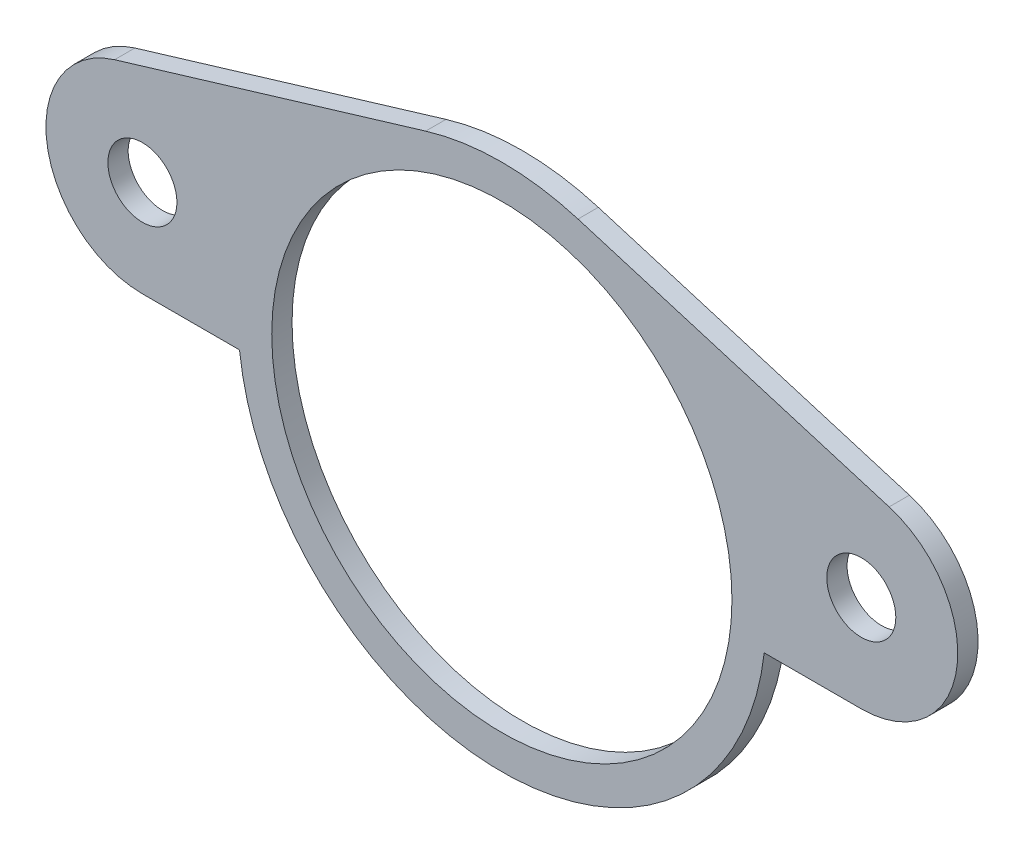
from build123d import *

# Parameters (mm, degrees)
SKETCH1_R           = 1.7
SKETCH1_R_2         = 11.33
BOSS_EXTRUDE1_DEPTH = 1


with BuildPart() as part:
    # Sketch1 → Boss-Extrude1 (new body)
    with BuildSketch(Plane.XY):
        with BuildLine():
            Line((12.917106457, -1.465728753), (17.697840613, -1.465728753))
            ThreePointArc((17.697840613, -1.465728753), (22.397086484, 2.591748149), (19.068087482, 7.832339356))
            Line((19.068087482, 7.832339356), (3.750149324, 12.447344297))
            ThreePointArc((3.750149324, 12.447344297), (0, 13), (-3.750149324, 12.447344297))
            Line((-3.750149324, 12.447344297), (-19.068087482, 7.832339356))
            ThreePointArc((-19.068087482, 7.832339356), (-22.397086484, 2.591748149), (-17.697840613, -1.465728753))
            Line((-17.697840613, -1.465728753), (-12.917106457, -1.465728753))
            ThreePointArc((-12.917106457, -1.465728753), (0, -13), (12.917106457, -1.465728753))
        make_face()
        with Locations((-17.697840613, 3.284271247)):
            Circle(SKETCH1_R, mode=Mode.SUBTRACT)
        with Locations((17.697840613, 3.284271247)):
            Circle(SKETCH1_R, mode=Mode.SUBTRACT)
        Circle(SKETCH1_R_2, mode=Mode.SUBTRACT)
    extrude(amount=BOSS_EXTRUDE1_DEPTH)


solid = part.part
